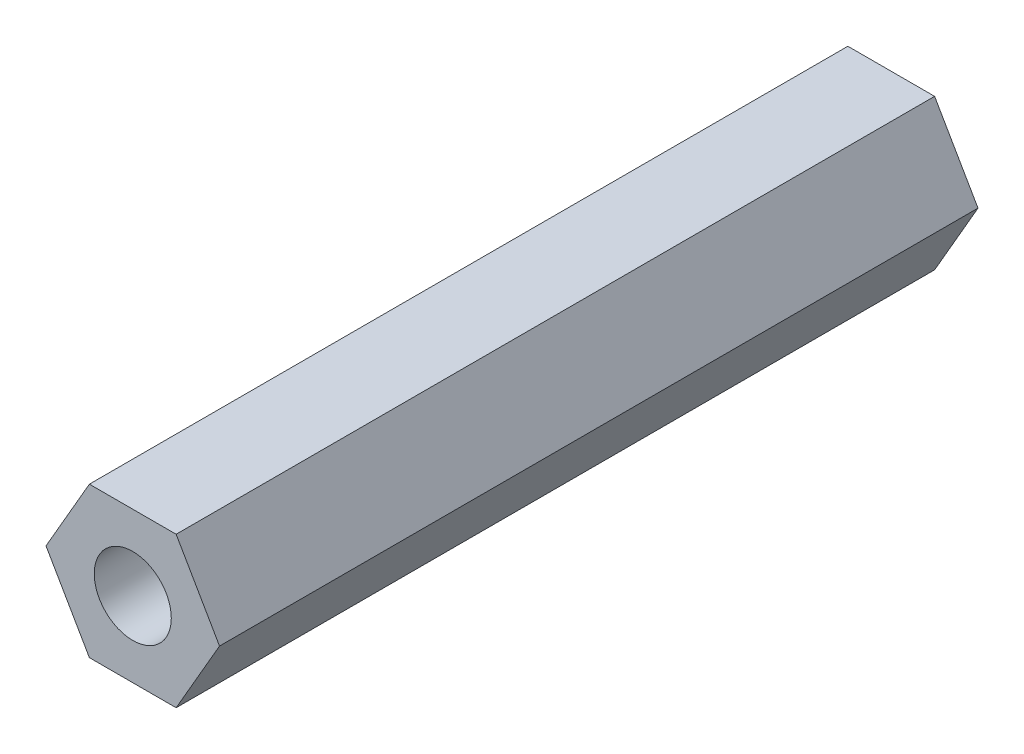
from build123d import *

# Parameters (mm, degrees)
BOSS_EXTRUDE1_DEPTH     = 10
CUT_EXTRUDE1_DEPTH      = 21.227671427
CUT_EXTRUDE1_DEPTH_BACK = 21.227671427
SKETCH5_R               = 1.016


with BuildPart() as part:
    # Sketch1 → Boss-Extrude1 (new, symmetric)
    with BuildSketch(Plane.XY):
        Polygon((1.143846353, 1.9812), (-1.143846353, 1.9812), (-2.287692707, 0), (-1.143846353, -1.9812), (1.143846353, -1.9812), (2.287692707, 0), align=None)
    extrude(amount=BOSS_EXTRUDE1_DEPTH, both=True)

    # Sketch5 → Cut-Extrude1 (cut, two sides: drawn at the far end of the back side and taken through both)
    with BuildSketch(Plane.XY.offset(10).offset(-CUT_EXTRUDE1_DEPTH_BACK)):
        Circle(SKETCH5_R)
    extrude(amount=CUT_EXTRUDE1_DEPTH + CUT_EXTRUDE1_DEPTH_BACK, mode=Mode.SUBTRACT)


solid = part.part
